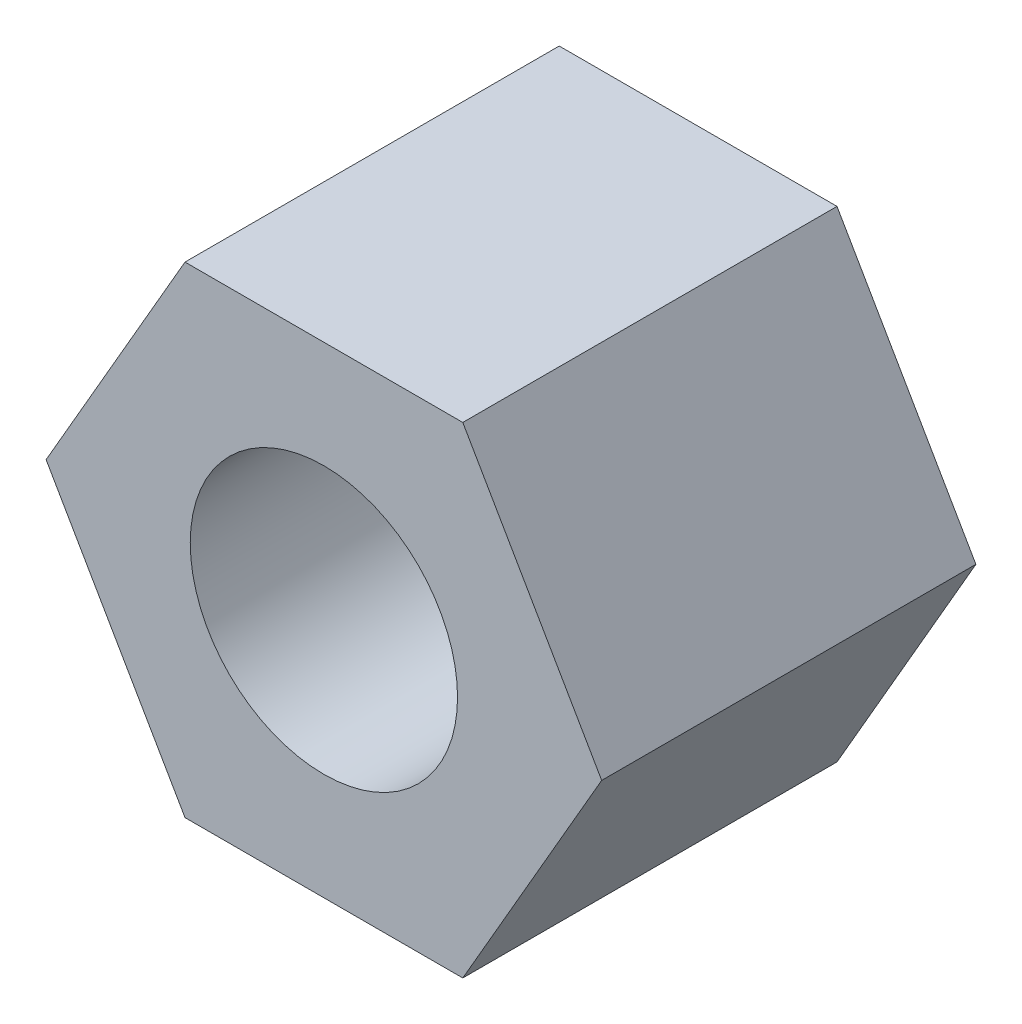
from build123d import *

# Parameters (mm, degrees)
SKETCH1_R           = 1.25
BOSS_EXTRUDE1_DEPTH = 3.5


with BuildPart() as part:
    # Sketch1 → Boss-Extrude1 (new body)
    with BuildSketch(Plane.XY):
        Polygon((-2.598076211, 0), (-1.299038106, -2.25), (1.299038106, -2.25), (2.598076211, 0), (1.299038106, 2.25), (-1.299038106, 2.25), align=None)
        Circle(SKETCH1_R, mode=Mode.SUBTRACT)
    extrude(amount=BOSS_EXTRUDE1_DEPTH)


solid = part.part
